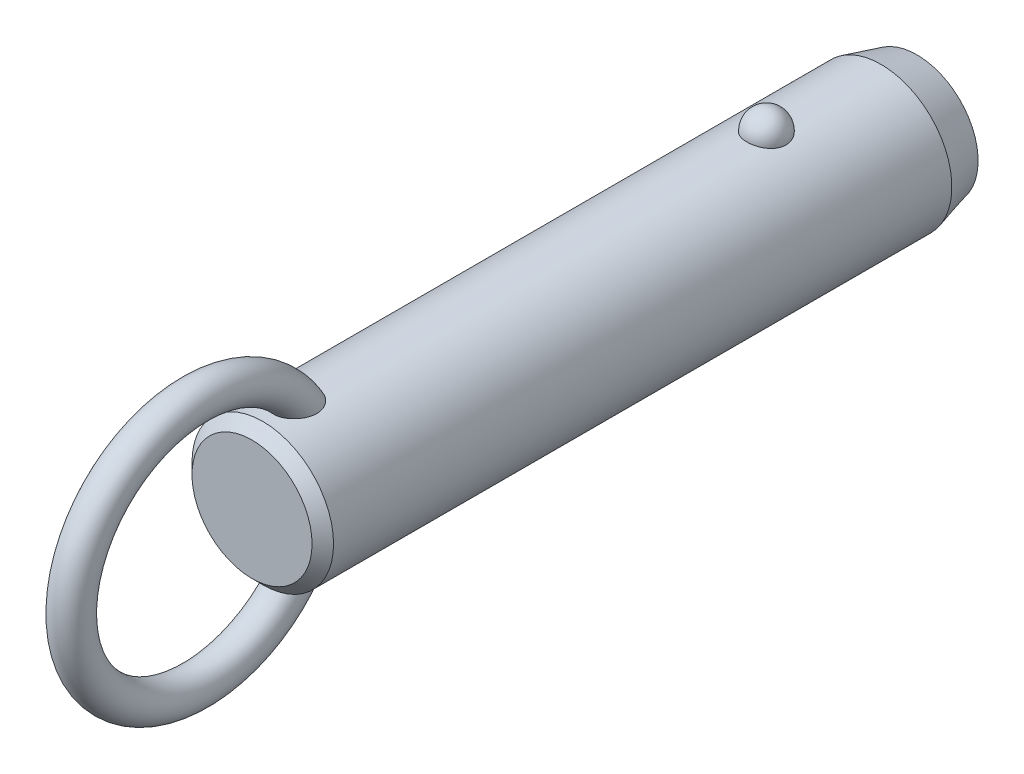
ISO-10303-21;
HEADER;
FILE_DESCRIPTION(('STEP AP214'),'2;1');
FILE_NAME('part.step','',(''),(''),'','','');
FILE_SCHEMA(('AUTOMOTIVE_DESIGN { 1 0 10303 214 1 1 1 1 }'));
ENDSEC;
DATA;
#1=APPLICATION_CONTEXT('core data for automotive mechanical design processes');
#2=APPLICATION_PROTOCOL_DEFINITION('international standard','automotive_design',2000,#1);
#3=PRODUCT_CONTEXT('',#1,'mechanical');
#4=PRODUCT('Part','Part','',(#3));
#5=PRODUCT_RELATED_PRODUCT_CATEGORY('part','',(#4));
#6=PRODUCT_DEFINITION_FORMATION('','',#4);
#7=PRODUCT_DEFINITION_CONTEXT('part definition',#1,'design');
#8=PRODUCT_DEFINITION('design','',#6,#7);
#9=PRODUCT_DEFINITION_SHAPE('','',#8);
#10=(LENGTH_UNIT() NAMED_UNIT(*) SI_UNIT(.MILLI.,.METRE.));
#11=(NAMED_UNIT(*) PLANE_ANGLE_UNIT() SI_UNIT($,.RADIAN.));
#12=(NAMED_UNIT(*) SI_UNIT($,.STERADIAN.) SOLID_ANGLE_UNIT());
#13=UNCERTAINTY_MEASURE_WITH_UNIT(LENGTH_MEASURE(1.E-05),#10,'distance_accuracy_value','');
#14=(GEOMETRIC_REPRESENTATION_CONTEXT(3) GLOBAL_UNCERTAINTY_ASSIGNED_CONTEXT((#13)) GLOBAL_UNIT_ASSIGNED_CONTEXT((#10,
#11,#12)) REPRESENTATION_CONTEXT('',''));
#15=CARTESIAN_POINT('',(0.,0.,0.));
#16=DIRECTION('',(0.,0.,1.));
#17=DIRECTION('',(1.,0.,0.));
#18=AXIS2_PLACEMENT_3D('',#15,#16,#17);
#19=CARTESIAN_POINT('',(0.,0.,45.7));
#20=DIRECTION('',(0.,0.,-1.));
#21=DIRECTION('',(-1.,0.,0.));
#22=AXIS2_PLACEMENT_3D('',#19,#20,#21);
#23=CYLINDRICAL_SURFACE('',#22,7.9);
#24=CARTESIAN_POINT('',(2.1785689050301,7.59367088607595,-2.2));
#25=CARTESIAN_POINT('',(2.17856679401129,7.59367269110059,-2.07701843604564));
#26=CARTESIAN_POINT('',(2.16853481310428,7.59657145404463,-1.95401006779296));
#27=CARTESIAN_POINT('',(2.12864689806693,7.607843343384,-1.71147811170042));
#28=CARTESIAN_POINT('',(2.09878338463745,7.61621856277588,-1.59195587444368));
#29=CARTESIAN_POINT('',(2.0199931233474,7.63749180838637,-1.35985638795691));
#30=CARTESIAN_POINT('',(1.97107475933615,7.6503878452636,-1.24727610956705));
#31=CARTESIAN_POINT('',(1.85539377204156,7.67926115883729,-1.03213234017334));
#32=CARTESIAN_POINT('',(1.78863158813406,7.69523835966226,-0.929568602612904));
#33=CARTESIAN_POINT('',(1.63856494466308,7.7285848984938,-0.73678633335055));
#34=CARTESIAN_POINT('',(1.55518140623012,7.7459606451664,-0.646630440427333));
#35=CARTESIAN_POINT('',(1.37422937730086,7.78009978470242,-0.481747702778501));
#36=CARTESIAN_POINT('',(1.27666086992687,7.79686317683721,-0.407020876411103));
#37=CARTESIAN_POINT('',(1.07024728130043,7.82786153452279,-0.275278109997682));
#38=CARTESIAN_POINT('',(0.961434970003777,7.84210353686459,-0.218212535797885));
#39=CARTESIAN_POINT('',(0.735351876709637,7.86652194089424,-0.123146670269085));
#40=CARTESIAN_POINT('',(0.618082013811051,7.87669878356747,-0.0851443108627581));
#41=CARTESIAN_POINT('',(0.380637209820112,7.89170521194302,-0.0298158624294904));
#42=CARTESIAN_POINT('',(0.260550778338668,7.89662650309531,-0.0121347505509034));
#43=CARTESIAN_POINT('',(0.0190117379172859,7.90090003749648,0.00324379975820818));
#44=CARTESIAN_POINT('',(-0.102440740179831,7.90025280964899,0.000943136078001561));
#45=CARTESIAN_POINT('',(-0.341452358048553,7.89351056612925,-0.0233955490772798));
#46=CARTESIAN_POINT('',(-0.459042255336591,7.88749257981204,-0.0451545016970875));
#47=CARTESIAN_POINT('',(-0.688796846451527,7.87075812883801,-0.107408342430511));
#48=CARTESIAN_POINT('',(-0.800961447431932,7.86004158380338,-0.147903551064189));
#49=CARTESIAN_POINT('',(-1.01743634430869,7.83497131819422,-0.246799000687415));
#50=CARTESIAN_POINT('',(-1.12169791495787,7.82059709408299,-0.305300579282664));
#51=CARTESIAN_POINT('',(-1.31891765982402,7.78976470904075,-0.438549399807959));
#52=CARTESIAN_POINT('',(-1.41187469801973,7.77330633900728,-0.513298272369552));
#53=CARTESIAN_POINT('',(-1.58577142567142,7.73972434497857,-0.678622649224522));
#54=CARTESIAN_POINT('',(-1.66645140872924,7.72259402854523,-0.76947005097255));
#55=CARTESIAN_POINT('',(-1.81161503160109,7.68983776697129,-0.963538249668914));
#56=CARTESIAN_POINT('',(-1.87609753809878,7.6742119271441,-1.06675991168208));
#57=CARTESIAN_POINT('',(-1.98790138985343,7.6460202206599,-1.28401170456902));
#58=CARTESIAN_POINT('',(-2.03501994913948,7.63349104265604,-1.39815107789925));
#59=CARTESIAN_POINT('',(-2.10986724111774,7.6131449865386,-1.63301784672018));
#60=CARTESIAN_POINT('',(-2.1375965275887,7.60532797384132,-1.75374505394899));
#61=CARTESIAN_POINT('',(-2.17289256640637,7.59531950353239,-1.99782562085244));
#62=CARTESIAN_POINT('',(-2.18054294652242,7.59310471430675,-2.12116592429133));
#63=CARTESIAN_POINT('',(-2.17572919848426,7.59448538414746,-2.36741799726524));
#64=CARTESIAN_POINT('',(-2.1632656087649,7.59808068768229,-2.49032977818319));
#65=CARTESIAN_POINT('',(-2.11865035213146,7.61064035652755,-2.73161015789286));
#66=CARTESIAN_POINT('',(-2.08659579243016,7.61957823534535,-2.84999812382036));
#67=CARTESIAN_POINT('',(-2.00367799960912,7.64179982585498,-3.07955956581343));
#68=CARTESIAN_POINT('',(-1.9528140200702,7.65508371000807,-3.19073275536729));
#69=CARTESIAN_POINT('',(-1.83321113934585,7.68460381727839,-3.40337899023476));
#70=CARTESIAN_POINT('',(-1.76437735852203,7.70085556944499,-3.50479651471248));
#71=CARTESIAN_POINT('',(-1.61069526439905,7.73445734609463,-3.69446912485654));
#72=CARTESIAN_POINT('',(-1.52584634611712,7.75180741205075,-3.78272371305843));
#73=CARTESIAN_POINT('',(-1.34198059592,7.78574608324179,-3.94393987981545));
#74=CARTESIAN_POINT('',(-1.24291308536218,7.80233167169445,-4.01684434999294));
#75=CARTESIAN_POINT('',(-1.03352039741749,7.83281625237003,-4.14489386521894));
#76=CARTESIAN_POINT('',(-0.923196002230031,7.84671543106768,-4.20004014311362));
#77=CARTESIAN_POINT('',(-0.695822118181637,7.87011575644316,-4.29042017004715));
#78=CARTESIAN_POINT('',(-0.578872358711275,7.87966903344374,-4.32589112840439));
#79=CARTESIAN_POINT('',(-0.340410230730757,7.8935652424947,-4.37692226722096));
#80=CARTESIAN_POINT('',(-0.218898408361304,7.89790879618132,-4.39248482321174));
#81=CARTESIAN_POINT('',(0.0228107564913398,7.90087453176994,-4.4031440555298));
#82=CARTESIAN_POINT('',(0.142990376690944,7.89960185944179,-4.3986168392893));
#83=CARTESIAN_POINT('',(0.380829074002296,7.89171262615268,-4.37008293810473));
#84=CARTESIAN_POINT('',(0.498488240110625,7.8850962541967,-4.34607694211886));
#85=CARTESIAN_POINT('',(0.727535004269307,7.86726442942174,-4.27939317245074));
#86=CARTESIAN_POINT('',(0.838944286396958,7.85606616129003,-4.23678512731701));
#87=CARTESIAN_POINT('',(1.05295421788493,7.83025654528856,-4.13408348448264));
#88=CARTESIAN_POINT('',(1.15555431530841,7.81564498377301,-4.07398879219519));
#89=CARTESIAN_POINT('',(1.35076763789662,7.7843022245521,-3.93687432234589));
#90=CARTESIAN_POINT('',(1.4432046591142,7.76754209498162,-3.85961036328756));
#91=CARTESIAN_POINT('',(1.6139111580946,7.73387857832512,-3.69076949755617));
#92=CARTESIAN_POINT('',(1.6921781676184,7.71697516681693,-3.59919010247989));
#93=CARTESIAN_POINT('',(1.83380875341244,7.6845643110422,-3.40247278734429));
#94=CARTESIAN_POINT('',(1.89689280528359,7.66908588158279,-3.29712873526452));
#95=CARTESIAN_POINT('',(2.0047823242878,7.64159441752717,-3.07707931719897));
#96=CARTESIAN_POINT('',(2.0495945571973,7.62958010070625,-2.96237743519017));
#97=CARTESIAN_POINT('',(2.11580183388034,7.61146617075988,-2.74040519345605));
#98=CARTESIAN_POINT('',(2.13929812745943,7.60484503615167,-2.63379846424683));
#99=CARTESIAN_POINT('',(2.17068242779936,7.59594664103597,-2.41813481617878));
#100=CARTESIAN_POINT('',(2.17857077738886,7.59366928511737,-2.30907795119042));
#101=CARTESIAN_POINT('',(2.1785689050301,7.59367088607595,-2.2));
#102=B_SPLINE_CURVE_WITH_KNOTS('',3,(#24,#25,#26,#27,#28,#29,#30,#31,#32,#33,#34,#35,#36,#37,
#38,#39,#40,#41,#42,#43,#44,#45,#46,#47,#48,#49,#50,#51,#52,#53,#54,#55,#56,#57,#58,#59,#60,#61,
#62,#63,#64,#65,#66,#67,#68,#69,#70,#71,#72,#73,#74,#75,#76,#77,#78,#79,#80,#81,#82,#83,#84,#85,
#86,#87,#88,#89,#90,#91,#92,#93,#94,#95,#96,#97,#98,#99,#100,#101),.UNSPECIFIED.,.T.,.F.,(4,2,2,
2,2,2,2,2,2,2,2,2,2,2,2,2,2,2,2,2,2,2,2,2,2,2,2,2,2,2,2,2,2,2,2,2,2,2,4),(0.,0.368552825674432,
0.737246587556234,1.10577831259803,1.4743009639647,1.84462067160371,2.21494081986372,
2.5842105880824,2.95344028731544,3.31611630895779,3.67875788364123,4.03628044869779,
4.39380913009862,4.75338791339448,5.11300280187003,5.47939989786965,5.8458226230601,
6.21639834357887,6.58696347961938,6.95598276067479,7.32499216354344,7.69218715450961,
8.0593967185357,8.42858578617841,8.79778880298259,9.16834203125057,9.5388695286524,
9.90482699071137,10.2707407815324,10.6298333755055,10.9889132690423,11.3466585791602,
11.7044262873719,12.0676511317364,12.4309391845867,12.8004764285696,13.1698767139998,
13.4967701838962,13.8236564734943),.UNSPECIFIED.);
#103=CARTESIAN_POINT('',(2.1785689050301,7.59367088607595,-2.2));
#104=VERTEX_POINT('',#103);
#105=EDGE_CURVE('E41',#104,#104,#102,.T.);
#106=ORIENTED_EDGE('',*,*,#105,.T.);
#107=EDGE_LOOP('',(#106));
#108=FACE_BOUND('',#107,.T.);
#109=CARTESIAN_POINT('',(0.,0.,54.02));
#110=DIRECTION('',(0.,0.,1.));
#111=DIRECTION('',(1.,0.,0.));
#112=AXIS2_PLACEMENT_3D('',#109,#110,#111);
#113=CIRCLE('',#112,7.9);
#114=CARTESIAN_POINT('',(7.9,0.,54.02));
#115=VERTEX_POINT('',#114);
#116=EDGE_CURVE('E10',#115,#115,#113,.F.);
#117=ORIENTED_EDGE('',*,*,#116,.T.);
#118=EDGE_LOOP('',(#117));
#119=FACE_BOUND('',#118,.T.);
#120=CARTESIAN_POINT('',(-0.630969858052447,-7.87476203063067,47.9124322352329));
#121=CARTESIAN_POINT('',(-0.734180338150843,-7.8664899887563,47.9472854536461));
#122=CARTESIAN_POINT('',(-0.83447695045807,-7.85639291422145,47.9908160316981));
#123=CARTESIAN_POINT('',(-1.0262035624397,-7.83366343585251,48.0940948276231));
#124=CARTESIAN_POINT('',(-1.1176141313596,-7.82102565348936,48.1538775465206));
#125=CARTESIAN_POINT('',(-1.28877277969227,-7.79464922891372,48.2878390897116));
#126=CARTESIAN_POINT('',(-1.36854014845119,-7.78091246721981,48.361993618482));
#127=CARTESIAN_POINT('',(-1.51461521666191,-7.75380398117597,48.5224941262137));
#128=CARTESIAN_POINT('',(-1.58092966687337,-7.74043207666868,48.6088339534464));
#129=CARTESIAN_POINT('',(-1.70019064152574,-7.71512522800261,48.7929784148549));
#130=CARTESIAN_POINT('',(-1.75284037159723,-7.70322473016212,48.8909792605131));
#131=CARTESIAN_POINT('',(-1.84263464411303,-7.68224112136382,49.0941029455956));
#132=CARTESIAN_POINT('',(-1.87977299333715,-7.6731591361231,49.1992286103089));
#133=CARTESIAN_POINT('',(-1.94152728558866,-7.65777930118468,49.4232849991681));
#134=CARTESIAN_POINT('',(-1.96475471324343,-7.65179654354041,49.5426167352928));
#135=CARTESIAN_POINT('',(-1.99449499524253,-7.64409642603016,49.7834298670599));
#136=CARTESIAN_POINT('',(-2.0010005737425,-7.64238092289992,49.9049121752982));
#137=CARTESIAN_POINT('',(-1.99856014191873,-7.64302120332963,50.1683409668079));
#138=CARTESIAN_POINT('',(-1.98680021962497,-7.64611845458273,50.3102565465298));
#139=CARTESIAN_POINT('',(-1.94457772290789,-7.65696186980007,50.5911188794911));
#140=CARTESIAN_POINT('',(-1.91409393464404,-7.66471330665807,50.7300620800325));
#141=CARTESIAN_POINT('',(-1.82768670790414,-7.68582947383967,51.0319397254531));
#142=CARTESIAN_POINT('',(-1.76772963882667,-7.70003779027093,51.193686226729));
#143=CARTESIAN_POINT('',(-1.65998501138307,-7.72371550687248,51.4276956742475));
#144=CARTESIAN_POINT('',(-1.621079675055,-7.73200670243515,51.5042974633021));
#145=CARTESIAN_POINT('',(-1.53727726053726,-7.74910377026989,51.6540798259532));
#146=CARTESIAN_POINT('',(-1.49238215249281,-7.75790947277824,51.7272615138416));
#147=CARTESIAN_POINT('',(-1.37397050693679,-7.77993338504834,51.9028838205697));
#148=CARTESIAN_POINT('',(-1.29690364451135,-7.79328473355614,52.0029557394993));
#149=CARTESIAN_POINT('',(-1.12885487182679,-7.81939266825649,52.1907147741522));
#150=CARTESIAN_POINT('',(-1.03789926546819,-7.83215032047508,52.2784247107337));
#151=CARTESIAN_POINT('',(-0.869532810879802,-7.85231710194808,52.4134148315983));
#152=CARTESIAN_POINT('',(-0.795716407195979,-7.86021093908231,52.465076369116));
#153=CARTESIAN_POINT('',(-0.640813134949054,-7.87434920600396,52.5563815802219));
#154=CARTESIAN_POINT('',(-0.559737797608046,-7.88059619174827,52.5960438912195));
#155=CARTESIAN_POINT('',(-0.406456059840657,-7.88984116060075,52.6543008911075));
#156=CARTESIAN_POINT('',(-0.33522794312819,-7.89321892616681,52.6753848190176));
#157=CARTESIAN_POINT('',(-0.190193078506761,-7.89804235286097,52.7054141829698));
#158=CARTESIAN_POINT('',(-0.116388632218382,-7.89948969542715,52.7143701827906));
#159=CARTESIAN_POINT('',(0.0318414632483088,-7.90028409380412,52.7192915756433));
#160=CARTESIAN_POINT('',(0.106268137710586,-7.89962640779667,52.7152276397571));
#161=CARTESIAN_POINT('',(0.25329066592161,-7.8962818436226,52.6944615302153));
#162=CARTESIAN_POINT('',(0.325885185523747,-7.8935935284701,52.6777504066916));
#163=CARTESIAN_POINT('',(0.48144171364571,-7.88577340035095,52.6287380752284));
#164=CARTESIAN_POINT('',(0.563611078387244,-7.88026321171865,52.594005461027));
#165=CARTESIAN_POINT('',(0.721129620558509,-7.86741729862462,52.5117965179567));
#166=CARTESIAN_POINT('',(0.796466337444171,-7.86007832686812,52.4642975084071));
#167=CARTESIAN_POINT('',(0.971456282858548,-7.84073285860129,52.336513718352));
#168=CARTESIAN_POINT('',(1.06719686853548,-7.82809461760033,52.2510047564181));
#169=CARTESIAN_POINT('',(1.24418921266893,-7.80192439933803,52.066232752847));
#170=CARTESIAN_POINT('',(1.32540832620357,-7.78839049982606,51.9669395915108));
#171=CARTESIAN_POINT('',(1.45199971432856,-7.76559693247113,51.7895760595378));
#172=CARTESIAN_POINT('',(1.50085649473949,-7.75626094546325,51.7139542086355));
#173=CARTESIAN_POINT('',(1.59197749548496,-7.7380727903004,51.5587428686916));
#174=CARTESIAN_POINT('',(1.63423919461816,-7.72922080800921,51.4791518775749));
#175=CARTESIAN_POINT('',(1.71222612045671,-7.71231959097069,51.3166640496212));
#176=CARTESIAN_POINT('',(1.74794516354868,-7.70427111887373,51.233764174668));
#177=CARTESIAN_POINT('',(1.81270113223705,-7.68929240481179,51.0652967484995));
#178=CARTESIAN_POINT('',(1.84173789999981,-7.68236218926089,50.9797291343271));
#179=CARTESIAN_POINT('',(1.89322698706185,-7.6698375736,50.8052870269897));
#180=CARTESIAN_POINT('',(1.91558744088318,-7.66426199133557,50.7163838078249));
#181=CARTESIAN_POINT('',(1.95281367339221,-7.65485915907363,50.5369696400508));
#182=CARTESIAN_POINT('',(1.96767946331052,-7.65103190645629,50.4464586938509));
#183=CARTESIAN_POINT('',(2.0002145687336,-7.64262981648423,50.1737320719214));
#184=CARTESIAN_POINT('',(2.00600691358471,-7.6410871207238,49.9897099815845));
#185=CARTESIAN_POINT('',(1.98445334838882,-7.64669564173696,49.6765019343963));
#186=CARTESIAN_POINT('',(1.96607186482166,-7.65149688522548,49.546618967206));
#187=CARTESIAN_POINT('',(1.90884967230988,-7.66597624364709,49.2916321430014));
#188=CARTESIAN_POINT('',(1.87002101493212,-7.67565148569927,49.166525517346));
#189=CARTESIAN_POINT('',(1.77063986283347,-7.69918471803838,48.9245401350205));
#190=CARTESIAN_POINT('',(1.70993724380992,-7.71307150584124,48.8077250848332));
#191=CARTESIAN_POINT('',(1.56733070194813,-7.74330306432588,48.5881444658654));
#192=CARTESIAN_POINT('',(1.48543692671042,-7.75964665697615,48.4853722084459));
#193=CARTESIAN_POINT('',(1.31346177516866,-7.79047523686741,48.3093800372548));
#194=CARTESIAN_POINT('',(1.22547278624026,-7.80495298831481,48.2341066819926));
#195=CARTESIAN_POINT('',(1.0372435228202,-7.83218597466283,48.1004864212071));
#196=CARTESIAN_POINT('',(0.937008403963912,-7.84494192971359,48.0421324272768));
#197=CARTESIAN_POINT('',(0.733599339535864,-7.86649045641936,47.9470270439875));
#198=CARTESIAN_POINT('',(0.630941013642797,-7.87547134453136,47.9092109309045));
#199=CARTESIAN_POINT('',(0.420465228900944,-7.88950708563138,47.8511160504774));
#200=CARTESIAN_POINT('',(0.312645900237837,-7.89456050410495,47.8308436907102));
#201=CARTESIAN_POINT('',(0.0960869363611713,-7.9001518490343,47.8084559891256));
#202=CARTESIAN_POINT('',(-0.0126341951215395,-7.90073226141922,47.8061698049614));
#203=CARTESIAN_POINT('',(-0.228766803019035,-7.89742350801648,47.8193678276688));
#204=CARTESIAN_POINT('',(-0.336180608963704,-7.89354403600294,47.8348134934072));
#205=CARTESIAN_POINT('',(-0.473410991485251,-7.88586871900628,47.8662177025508));
#206=CARTESIAN_POINT('',(-0.505257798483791,-7.88388984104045,47.8743541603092));
#207=CARTESIAN_POINT('',(-0.568481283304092,-7.87958326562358,47.8922083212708));
#208=CARTESIAN_POINT('',(-0.599857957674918,-7.87725556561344,47.9019260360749));
#209=CARTESIAN_POINT('',(-0.630969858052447,-7.87476203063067,47.9124322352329));
#210=B_SPLINE_CURVE_WITH_KNOTS('',3,(#120,#121,#122,#123,#124,#125,#126,#127,#128,#129,#130,
#131,#132,#133,#134,#135,#136,#137,#138,#139,#140,#141,#142,#143,#144,#145,#146,#147,#148,#149,
#150,#151,#152,#153,#154,#155,#156,#157,#158,#159,#160,#161,#162,#163,#164,#165,#166,#167,#168,
#169,#170,#171,#172,#173,#174,#175,#176,#177,#178,#179,#180,#181,#182,#183,#184,#185,#186,#187,
#188,#189,#190,#191,#192,#193,#194,#195,#196,#197,#198,#199,#200,#201,#202,#203,#204,#205,#206,
#207,#208,#209),.UNSPECIFIED.,.T.,.F.,(4,2,2,2,2,2,2,2,2,2,2,2,2,2,2,2,2,2,2,2,2,2,2,2,2,2,2,2,
2,2,2,2,2,2,2,2,2,2,2,2,2,2,2,2,4),(0.,0.327622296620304,0.655945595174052,0.983718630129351,
1.3113267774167,1.64554655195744,1.97989964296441,2.34365728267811,2.70757317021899,
3.13333684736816,3.55958380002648,4.07655306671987,4.3352789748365,4.593919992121,
4.9738243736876,5.35301797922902,5.62348245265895,5.89352465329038,6.11565959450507,
6.3376009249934,6.56004255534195,6.782641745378,7.04930844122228,7.31645206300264,
7.70130871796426,8.08701995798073,8.35824509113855,8.62957365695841,8.90115735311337,
9.17274746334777,9.44791855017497,9.72308922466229,10.2715298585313,10.6638393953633,
11.0559179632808,11.4507403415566,11.8453740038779,12.1936425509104,12.5417649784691,
12.8695063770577,13.1973674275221,13.5221104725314,13.8461490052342,13.9449071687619,
14.0436660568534),.UNSPECIFIED.);
#211=CARTESIAN_POINT('',(-0.630969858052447,-7.87476203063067,47.9124322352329));
#212=VERTEX_POINT('',#211);
#213=EDGE_CURVE('E59',#212,#212,#210,.T.);
#214=ORIENTED_EDGE('',*,*,#213,.T.);
#215=EDGE_LOOP('',(#214));
#216=FACE_BOUND('',#215,.T.);
#217=CARTESIAN_POINT('',(-0.630969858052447,7.87476203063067,47.9124322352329));
#218=CARTESIAN_POINT('',(-0.528918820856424,7.88293636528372,47.8779798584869));
#219=CARTESIAN_POINT('',(-0.423745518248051,7.8893481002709,47.851915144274));
#220=CARTESIAN_POINT('',(-0.210236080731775,7.8979273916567,47.8172825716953));
#221=CARTESIAN_POINT('',(-0.101893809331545,7.90008607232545,47.8087513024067));
#222=CARTESIAN_POINT('',(0.114660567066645,7.89990877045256,47.8094570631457));
#223=CARTESIAN_POINT('',(0.22287270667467,7.89757640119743,47.8186798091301));
#224=CARTESIAN_POINT('',(0.436107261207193,7.88867538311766,47.8546525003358));
#225=CARTESIAN_POINT('',(0.541131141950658,7.8821087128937,47.8813942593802));
#226=CARTESIAN_POINT('',(0.745085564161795,7.86545130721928,47.9517561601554));
#227=CARTESIAN_POINT('',(0.844015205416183,7.85536005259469,47.9953787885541));
#228=CARTESIAN_POINT('',(1.03299167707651,7.83275153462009,48.0983796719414));
#229=CARTESIAN_POINT('',(1.12303841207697,7.8202342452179,48.1577580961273));
#230=CARTESIAN_POINT('',(1.29214734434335,7.79408219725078,48.2908647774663));
#231=CARTESIAN_POINT('',(1.37116907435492,7.78044359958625,48.3646436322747));
#232=CARTESIAN_POINT('',(1.51597677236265,7.75353170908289,48.5242353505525));
#233=CARTESIAN_POINT('',(1.58176261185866,7.74025841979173,48.6100483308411));
#234=CARTESIAN_POINT('',(1.70057386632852,7.71504069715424,48.793644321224));
#235=CARTESIAN_POINT('',(1.75320073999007,7.7031425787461,48.8916906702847));
#236=CARTESIAN_POINT('',(1.8429376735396,7.68216822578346,49.0948931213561));
#237=CARTESIAN_POINT('',(1.88004278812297,7.67309289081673,49.2000514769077));
#238=CARTESIAN_POINT('',(1.9417232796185,7.6577294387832,49.4241671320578));
#239=CARTESIAN_POINT('',(1.96491037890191,7.65175648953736,49.5435248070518));
#240=CARTESIAN_POINT('',(1.9945689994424,7.64407702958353,49.7843848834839));
#241=CARTESIAN_POINT('',(2.00103304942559,7.64237242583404,49.9058882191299));
#242=CARTESIAN_POINT('',(1.99850166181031,7.64303650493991,50.1693688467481));
#243=CARTESIAN_POINT('',(1.98669038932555,7.64614714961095,50.3113141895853));
#244=CARTESIAN_POINT('',(1.94436120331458,7.6570170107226,50.5922287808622));
#245=CARTESIAN_POINT('',(1.91382203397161,7.66478150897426,50.7311944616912));
#246=CARTESIAN_POINT('',(1.82728754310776,7.68592483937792,51.0331110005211));
#247=CARTESIAN_POINT('',(1.76725778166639,7.7001468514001,51.194872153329));
#248=CARTESIAN_POINT('',(1.65939700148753,7.72384204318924,51.4288914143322));
#249=CARTESIAN_POINT('',(1.62045187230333,7.73213852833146,51.5054942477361));
#250=CARTESIAN_POINT('',(1.5365668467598,7.74924489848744,51.6552737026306));
#251=CARTESIAN_POINT('',(1.49162892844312,7.75805461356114,51.7284514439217));
#252=CARTESIAN_POINT('',(1.37317698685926,7.78007342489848,51.9039520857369));
#253=CARTESIAN_POINT('',(1.29612360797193,7.79341423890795,52.0039112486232));
#254=CARTESIAN_POINT('',(1.12812043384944,7.81949839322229,52.1914508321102));
#255=CARTESIAN_POINT('',(1.03719688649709,7.83224280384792,52.2790540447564));
#256=CARTESIAN_POINT('',(0.868871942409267,7.85239026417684,52.4138971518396));
#257=CARTESIAN_POINT('',(0.795056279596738,7.86027769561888,52.4655113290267));
#258=CARTESIAN_POINT('',(0.640160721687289,7.87440222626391,52.5567201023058));
#259=CARTESIAN_POINT('',(0.559092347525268,7.88064188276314,52.5963333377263));
#260=CARTESIAN_POINT('',(0.40582092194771,7.8898738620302,52.6545056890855));
#261=CARTESIAN_POINT('',(0.334594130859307,7.89324577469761,52.6755523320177));
#262=CARTESIAN_POINT('',(0.189568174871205,7.89805733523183,52.7055070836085));
#263=CARTESIAN_POINT('',(0.115771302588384,7.89949866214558,52.7144257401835));
#264=CARTESIAN_POINT('',(-0.0324359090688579,7.90028156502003,52.7192758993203));
#265=CARTESIAN_POINT('',(-0.106847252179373,7.89961843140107,52.7151782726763));
#266=CARTESIAN_POINT('',(-0.253834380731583,7.8962642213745,52.6943519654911));
#267=CARTESIAN_POINT('',(-0.326408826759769,7.89357170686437,52.6776143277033));
#268=CARTESIAN_POINT('',(-0.481962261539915,7.88574179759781,52.6285391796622));
#269=CARTESIAN_POINT('',(-0.564145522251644,7.88022507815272,52.5937638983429));
#270=CARTESIAN_POINT('',(-0.72168526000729,7.86736646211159,52.5114686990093));
#271=CARTESIAN_POINT('',(-0.797029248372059,7.8600213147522,52.4639260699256));
#272=CARTESIAN_POINT('',(-0.9720442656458,7.84066026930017,52.3360267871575));
#273=CARTESIAN_POINT('',(-1.06779803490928,7.82801274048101,52.2504436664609));
#274=CARTESIAN_POINT('',(-1.2448053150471,7.80182621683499,52.0655223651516));
#275=CARTESIAN_POINT('',(-1.32602618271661,7.78828530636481,51.9661540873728));
#276=CARTESIAN_POINT('',(-1.45259834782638,7.76548487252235,51.7886806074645));
#277=CARTESIAN_POINT('',(-1.50143856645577,7.75614818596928,51.7130252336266));
#278=CARTESIAN_POINT('',(-1.59252410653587,7.73796020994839,51.5577484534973));
#279=CARTESIAN_POINT('',(-1.63476690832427,7.72910910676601,51.4781255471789));
#280=CARTESIAN_POINT('',(-1.71271318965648,7.71221133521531,51.3155750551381));
#281=CARTESIAN_POINT('',(-1.74841047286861,7.70416543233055,51.2326444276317));
#282=CARTESIAN_POINT('',(-1.81311929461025,7.6891937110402,51.0641168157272));
#283=CARTESIAN_POINT('',(-1.84213067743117,7.68226791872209,50.9785197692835));
#284=CARTESIAN_POINT('',(-1.89356259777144,7.66975461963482,50.8040254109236));
#285=CARTESIAN_POINT('',(-1.91589165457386,7.66418586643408,50.7150995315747));
#286=CARTESIAN_POINT('',(-1.95305070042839,7.65479859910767,50.5356424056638));
#287=CARTESIAN_POINT('',(-1.96788069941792,7.65098008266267,50.4451111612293));
#288=CARTESIAN_POINT('',(-2.00030078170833,7.64260704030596,50.1723270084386));
#289=CARTESIAN_POINT('',(-2.00600576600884,7.64108760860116,49.9882718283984));
#290=CARTESIAN_POINT('',(-1.98428483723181,7.64673945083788,49.6750800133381));
#291=CARTESIAN_POINT('',(-1.96583698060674,7.65155751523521,49.5452400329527));
#292=CARTESIAN_POINT('',(-1.90848948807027,7.66606613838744,49.2903619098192));
#293=CARTESIAN_POINT('',(-1.86960376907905,7.67575338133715,49.165320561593));
#294=CARTESIAN_POINT('',(-1.77013421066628,7.6993013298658,48.9235009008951));
#295=CARTESIAN_POINT('',(-1.70940488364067,7.71318991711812,48.8067844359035));
#296=CARTESIAN_POINT('',(-1.56672953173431,7.74342495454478,48.5873404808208));
#297=CARTESIAN_POINT('',(-1.48478316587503,7.75977144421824,48.4846132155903));
#298=CARTESIAN_POINT('',(-1.31266325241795,7.79061163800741,48.308643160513));
#299=CARTESIAN_POINT('',(-1.22456383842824,7.80509908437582,48.2333589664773));
#300=CARTESIAN_POINT('',(-1.0362240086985,7.83231881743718,48.0998659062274));
#301=CARTESIAN_POINT('',(-0.936015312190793,7.84505551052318,48.0416137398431));
#302=CARTESIAN_POINT('',(-0.798824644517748,7.85957802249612,47.9775408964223));
#303=CARTESIAN_POINT('',(-0.765787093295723,7.86286821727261,47.9632248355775));
#304=CARTESIAN_POINT('',(-0.698939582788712,7.86909211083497,47.936436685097));
#305=CARTESIAN_POINT('',(-0.665129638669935,7.8720258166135,47.9239645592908));
#306=CARTESIAN_POINT('',(-0.630969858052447,7.87476203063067,47.9124322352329));
#307=B_SPLINE_CURVE_WITH_KNOTS('',3,(#217,#218,#219,#220,#221,#222,#223,#224,#225,#226,#227,
#228,#229,#230,#231,#232,#233,#234,#235,#236,#237,#238,#239,#240,#241,#242,#243,#244,#245,#246,
#247,#248,#249,#250,#251,#252,#253,#254,#255,#256,#257,#258,#259,#260,#261,#262,#263,#264,#265,
#266,#267,#268,#269,#270,#271,#272,#273,#274,#275,#276,#277,#278,#279,#280,#281,#282,#283,#284,
#285,#286,#287,#288,#289,#290,#291,#292,#293,#294,#295,#296,#297,#298,#299,#300,#301,#302,#303,
#304,#305,#306),.UNSPECIFIED.,.T.,.F.,(4,2,2,2,2,2,2,2,2,2,2,2,2,2,2,2,2,2,2,2,2,2,2,2,2,2,2,2,
2,2,2,2,2,2,2,2,2,2,2,2,2,2,2,2,4),(0.,0.32392037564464,0.64851603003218,0.972850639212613,
1.29703380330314,1.62126473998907,1.94549915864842,2.27089401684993,2.59629203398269,
2.93059633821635,3.26500707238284,3.6288164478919,3.99278833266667,4.41865421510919,
4.84500434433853,5.36209210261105,5.62087589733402,5.87957448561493,6.25918598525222,
6.63808782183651,6.90846748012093,7.17842501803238,7.40052350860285,7.62242871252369,
7.84483086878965,8.0673907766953,8.33414615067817,8.60137921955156,8.98641454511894,
9.37230415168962,9.64358673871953,9.9149726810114,10.1866142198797,10.4582620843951,
10.7334745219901,11.008686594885,11.5572126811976,11.9494246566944,12.3413699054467,
12.7359755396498,13.1305875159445,13.4791770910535,13.82687259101,13.9353013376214,
14.0437279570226),.UNSPECIFIED.);
#308=CARTESIAN_POINT('',(-0.630969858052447,7.87476203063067,47.9124322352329));
#309=VERTEX_POINT('',#308);
#310=EDGE_CURVE('E66',#309,#309,#307,.T.);
#311=ORIENTED_EDGE('',*,*,#310,.T.);
#312=EDGE_LOOP('',(#311));
#313=FACE_BOUND('',#312,.T.);
#314=CARTESIAN_POINT('',(0.,0.,-15.));
#315=DIRECTION('',(0.,0.,-1.));
#316=DIRECTION('',(-1.,0.,0.));
#317=AXIS2_PLACEMENT_3D('',#314,#315,#316);
#318=CIRCLE('',#317,7.9);
#319=CARTESIAN_POINT('',(-7.9,0.,-15.));
#320=VERTEX_POINT('',#319);
#321=EDGE_CURVE('E56',#320,#320,#318,.F.);
#322=ORIENTED_EDGE('',*,*,#321,.T.);
#323=EDGE_LOOP('',(#322));
#324=FACE_BOUND('',#323,.T.);
#325=ADVANCED_FACE('F37',(#108,#119,#216,#313,#324),#23,.T.);
#326=CARTESIAN_POINT('',(0.,0.,-19.));
#327=DIRECTION('',(0.,0.,-1.));
#328=DIRECTION('',(-1.,0.,0.));
#329=AXIS2_PLACEMENT_3D('',#326,#327,#328);
#330=PLANE('',#329);
#331=CARTESIAN_POINT('',(0.,0.,-19.));
#332=DIRECTION('',(0.,0.,-1.));
#333=DIRECTION('',(-1.,0.,0.));
#334=AXIS2_PLACEMENT_3D('',#331,#332,#333);
#335=CIRCLE('',#334,6.82820323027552);
#336=CARTESIAN_POINT('',(-6.82820323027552,0.,-19.));
#337=VERTEX_POINT('',#336);
#338=EDGE_CURVE('E65',#337,#337,#335,.T.);
#339=ORIENTED_EDGE('',*,*,#338,.T.);
#340=EDGE_LOOP('',(#339));
#341=FACE_BOUND('',#340,.T.);
#342=ADVANCED_FACE('F84',(#341),#330,.T.);
#343=CARTESIAN_POINT('',(0.,0.,-19.));
#344=DIRECTION('',(0.,0.,1.));
#345=DIRECTION('',(1.,0.,0.));
#346=AXIS2_PLACEMENT_3D('',#343,#344,#345);
#347=CONICAL_SURFACE('',#346,6.82820323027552,0.26179938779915);
#348=ORIENTED_EDGE('',*,*,#321,.F.);
#349=EDGE_LOOP('',(#348));
#350=FACE_BOUND('',#349,.T.);
#351=ORIENTED_EDGE('',*,*,#338,.F.);
#352=EDGE_LOOP('',(#351));
#353=FACE_BOUND('',#352,.T.);
#354=ADVANCED_FACE('F82',(#350,#353),#347,.T.);
#355=CARTESIAN_POINT('',(0.,0.,55.22));
#356=DIRECTION('',(0.,0.,1.));
#357=DIRECTION('',(1.,0.,0.));
#358=AXIS2_PLACEMENT_3D('',#355,#356,#357);
#359=PLANE('',#358);
#360=CARTESIAN_POINT('',(0.,0.,55.22));
#361=DIRECTION('',(0.,0.,1.));
#362=DIRECTION('',(1.,0.,0.));
#363=AXIS2_PLACEMENT_3D('',#360,#361,#362);
#364=CIRCLE('',#363,6.70000000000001);
#365=CARTESIAN_POINT('',(6.70000000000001,0.,55.22));
#366=VERTEX_POINT('',#365);
#367=EDGE_CURVE('E50',#366,#366,#364,.T.);
#368=ORIENTED_EDGE('',*,*,#367,.T.);
#369=EDGE_LOOP('',(#368));
#370=FACE_BOUND('',#369,.T.);
#371=ADVANCED_FACE('F76',(#370),#359,.T.);
#372=CARTESIAN_POINT('',(0.,0.,61.55));
#373=DIRECTION('',(1.,0.,0.));
#374=DIRECTION('',(0.,0.,-1.));
#375=AXIS2_PLACEMENT_3D('',#372,#373,#374);
#376=TOROIDAL_SURFACE('',#375,13.85,2.);
#377=ORIENTED_EDGE('',*,*,#310,.F.);
#378=EDGE_LOOP('',(#377));
#379=FACE_BOUND('',#378,.T.);
#380=ORIENTED_EDGE('',*,*,#213,.F.);
#381=EDGE_LOOP('',(#380));
#382=FACE_BOUND('',#381,.T.);
#383=ADVANCED_FACE('F72',(#379,#382),#376,.T.);
#384=CARTESIAN_POINT('',(0.,0.,55.22));
#385=DIRECTION('',(0.,0.,-1.));
#386=DIRECTION('',(-1.,0.,0.));
#387=AXIS2_PLACEMENT_3D('',#384,#385,#386);
#388=CONICAL_SURFACE('',#387,6.70000000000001,0.785398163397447);
#389=ORIENTED_EDGE('',*,*,#116,.F.);
#390=EDGE_LOOP('',(#389));
#391=FACE_BOUND('',#390,.T.);
#392=ORIENTED_EDGE('',*,*,#367,.F.);
#393=EDGE_LOOP('',(#392));
#394=FACE_BOUND('',#393,.T.);
#395=ADVANCED_FACE('F39',(#391,#394),#388,.T.);
#396=CARTESIAN_POINT('',(0.,7.9,-2.2));
#397=DIRECTION('',(0.,1.,0.));
#398=DIRECTION('',(0.,0.,1.));
#399=AXIS2_PLACEMENT_3D('',#396,#397,#398);
#400=SPHERICAL_SURFACE('',#399,2.2);
#401=ORIENTED_EDGE('',*,*,#105,.F.);
#402=EDGE_LOOP('',(#401));
#403=FACE_BOUND('',#402,.T.);
#404=ADVANCED_FACE('F78',(#403),#400,.T.);
#405=CLOSED_SHELL('',(#325,#342,#354,#371,#383,#395,#404));
#406=MANIFOLD_SOLID_BREP('B2',#405);
#407=ADVANCED_BREP_SHAPE_REPRESENTATION('',(#18,#406),#14);
#408=SHAPE_DEFINITION_REPRESENTATION(#9,#407);
ENDSEC;
END-ISO-10303-21;
